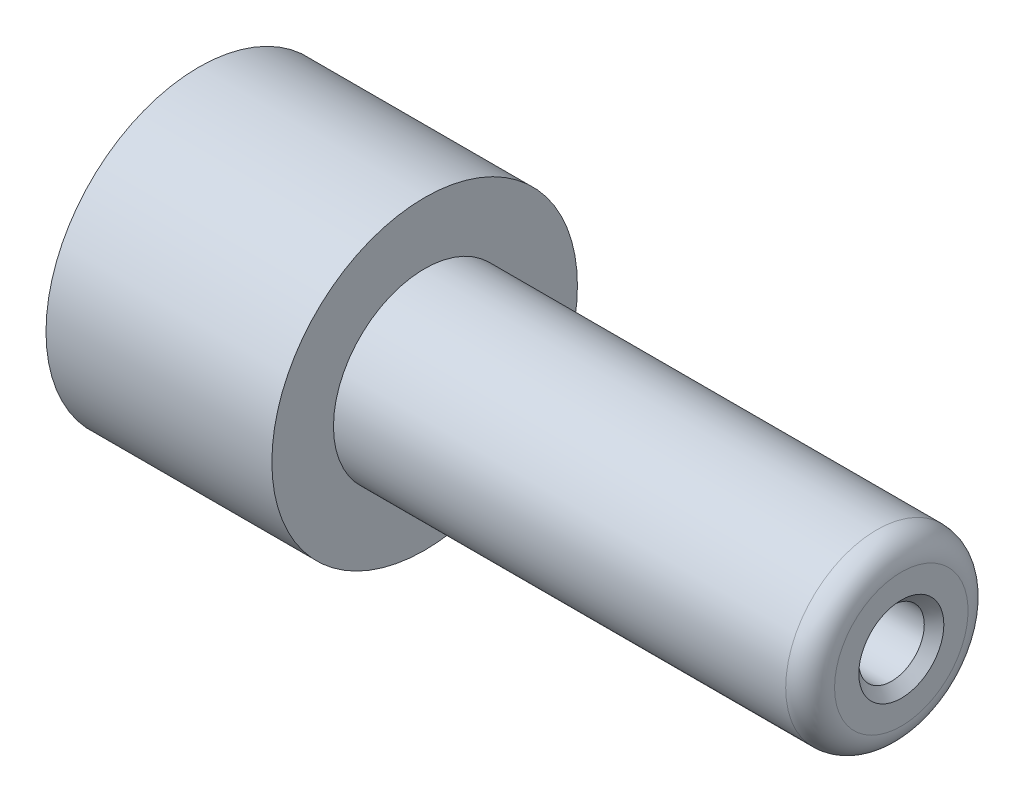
ISO-10303-21;
HEADER;
FILE_DESCRIPTION(('STEP AP214'),'2;1');
FILE_NAME('part.step','',(''),(''),'','','');
FILE_SCHEMA(('AUTOMOTIVE_DESIGN { 1 0 10303 214 1 1 1 1 }'));
ENDSEC;
DATA;
#1=APPLICATION_CONTEXT('core data for automotive mechanical design processes');
#2=APPLICATION_PROTOCOL_DEFINITION('international standard','automotive_design',2000,#1);
#3=PRODUCT_CONTEXT('',#1,'mechanical');
#4=PRODUCT('Part','Part','',(#3));
#5=PRODUCT_RELATED_PRODUCT_CATEGORY('part','',(#4));
#6=PRODUCT_DEFINITION_FORMATION('','',#4);
#7=PRODUCT_DEFINITION_CONTEXT('part definition',#1,'design');
#8=PRODUCT_DEFINITION('design','',#6,#7);
#9=PRODUCT_DEFINITION_SHAPE('','',#8);
#10=(LENGTH_UNIT() NAMED_UNIT(*) SI_UNIT(.MILLI.,.METRE.));
#11=(NAMED_UNIT(*) PLANE_ANGLE_UNIT() SI_UNIT($,.RADIAN.));
#12=(NAMED_UNIT(*) SI_UNIT($,.STERADIAN.) SOLID_ANGLE_UNIT());
#13=UNCERTAINTY_MEASURE_WITH_UNIT(LENGTH_MEASURE(1.E-05),#10,'distance_accuracy_value','');
#14=(GEOMETRIC_REPRESENTATION_CONTEXT(3) GLOBAL_UNCERTAINTY_ASSIGNED_CONTEXT((#13)) GLOBAL_UNIT_ASSIGNED_CONTEXT((#10,
#11,#12)) REPRESENTATION_CONTEXT('',''));
#15=CARTESIAN_POINT('',(0.,0.,0.));
#16=DIRECTION('',(0.,0.,1.));
#17=DIRECTION('',(1.,0.,0.));
#18=AXIS2_PLACEMENT_3D('',#15,#16,#17);
#19=CARTESIAN_POINT('',(0.,0.,0.));
#20=DIRECTION('',(-1.,0.,0.));
#21=DIRECTION('',(0.,0.,1.));
#22=AXIS2_PLACEMENT_3D('',#19,#20,#21);
#23=CYLINDRICAL_SURFACE('',#22,3.5687);
#24=CARTESIAN_POINT('',(24.4856,0.,0.));
#25=DIRECTION('',(-1.,0.,0.));
#26=DIRECTION('',(0.,0.,1.));
#27=AXIS2_PLACEMENT_3D('',#24,#25,#26);
#28=CIRCLE('',#27,3.5687);
#29=CARTESIAN_POINT('',(24.4856,0.,3.5687));
#30=VERTEX_POINT('',#29);
#31=EDGE_CURVE('E44',#30,#30,#28,.T.);
#32=ORIENTED_EDGE('',*,*,#31,.F.);
#33=EDGE_LOOP('',(#32));
#34=FACE_BOUND('',#33,.T.);
#35=CARTESIAN_POINT('',(0.,0.,0.));
#36=DIRECTION('',(-1.,0.,0.));
#37=DIRECTION('',(0.,0.,1.));
#38=AXIS2_PLACEMENT_3D('',#35,#36,#37);
#39=CIRCLE('',#38,3.5687);
#40=CARTESIAN_POINT('',(0.,0.,3.5687));
#41=VERTEX_POINT('',#40);
#42=EDGE_CURVE('E65',#41,#41,#39,.T.);
#43=ORIENTED_EDGE('',*,*,#42,.T.);
#44=EDGE_LOOP('',(#43));
#45=FACE_BOUND('',#44,.T.);
#46=ADVANCED_FACE('F33',(#34,#45),#23,.F.);
#47=CARTESIAN_POINT('',(24.4856,3.5687,0.));
#48=DIRECTION('',(1.,0.,0.));
#49=DIRECTION('',(0.,0.,-1.));
#50=AXIS2_PLACEMENT_3D('',#47,#48,#49);
#51=PLANE('',#50);
#52=ORIENTED_EDGE('',*,*,#31,.T.);
#53=EDGE_LOOP('',(#52));
#54=FACE_BOUND('',#53,.T.);
#55=ADVANCED_FACE('F99',(#54),#51,.F.);
#56=CARTESIAN_POINT('',(36.4998,3.4671,0.));
#57=DIRECTION('',(-1.,0.,0.));
#58=DIRECTION('',(0.,0.,1.));
#59=AXIS2_PLACEMENT_3D('',#56,#57,#58);
#60=PLANE('',#59);
#61=CARTESIAN_POINT('',(36.4998,0.,0.));
#62=DIRECTION('',(-1.,0.,0.));
#63=DIRECTION('',(0.,0.,1.));
#64=AXIS2_PLACEMENT_3D('',#61,#62,#63);
#65=CIRCLE('',#64,2.20980000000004);
#66=CARTESIAN_POINT('',(36.4998,0.,2.20980000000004));
#67=VERTEX_POINT('',#66);
#68=EDGE_CURVE('E10',#67,#67,#65,.T.);
#69=ORIENTED_EDGE('',*,*,#68,.T.);
#70=EDGE_LOOP('',(#69));
#71=FACE_BOUND('',#70,.T.);
#72=CARTESIAN_POINT('',(36.4998,0.,0.));
#73=DIRECTION('',(-1.,0.,0.));
#74=DIRECTION('',(0.,0.,1.));
#75=AXIS2_PLACEMENT_3D('',#72,#73,#74);
#76=CIRCLE('',#75,3.4671);
#77=CARTESIAN_POINT('',(36.4998,0.,3.4671));
#78=VERTEX_POINT('',#77);
#79=EDGE_CURVE('E48',#78,#78,#76,.T.);
#80=ORIENTED_EDGE('',*,*,#79,.F.);
#81=EDGE_LOOP('',(#80));
#82=FACE_BOUND('',#81,.T.);
#83=ADVANCED_FACE('F104',(#71,#82),#60,.F.);
#84=CARTESIAN_POINT('',(35.2298,0.,0.));
#85=DIRECTION('',(-1.,0.,0.));
#86=DIRECTION('',(0.,0.,1.));
#87=AXIS2_PLACEMENT_3D('',#84,#85,#86);
#88=TOROIDAL_SURFACE('',#87,3.4671,1.27);
#89=CARTESIAN_POINT('',(35.2298,0.,0.));
#90=DIRECTION('',(-1.,0.,0.));
#91=DIRECTION('',(0.,0.,1.));
#92=AXIS2_PLACEMENT_3D('',#89,#90,#91);
#93=CIRCLE('',#92,4.7371);
#94=CARTESIAN_POINT('',(35.2298,0.,4.7371));
#95=VERTEX_POINT('',#94);
#96=EDGE_CURVE('E53',#95,#95,#93,.T.);
#97=ORIENTED_EDGE('',*,*,#96,.F.);
#98=EDGE_LOOP('',(#97));
#99=FACE_BOUND('',#98,.T.);
#100=ORIENTED_EDGE('',*,*,#79,.T.);
#101=EDGE_LOOP('',(#100));
#102=FACE_BOUND('',#101,.T.);
#103=ADVANCED_FACE('F112',(#99,#102),#88,.T.);
#104=CARTESIAN_POINT('',(0.,0.,0.));
#105=DIRECTION('',(-1.,0.,0.));
#106=DIRECTION('',(0.,0.,1.));
#107=AXIS2_PLACEMENT_3D('',#104,#105,#106);
#108=CYLINDRICAL_SURFACE('',#107,4.7371);
#109=CARTESIAN_POINT('',(11.7348,0.,0.));
#110=DIRECTION('',(-1.,0.,0.));
#111=DIRECTION('',(0.,0.,1.));
#112=AXIS2_PLACEMENT_3D('',#109,#110,#111);
#113=CIRCLE('',#112,4.7371);
#114=CARTESIAN_POINT('',(11.7348,0.,4.7371));
#115=VERTEX_POINT('',#114);
#116=EDGE_CURVE('E56',#115,#115,#113,.T.);
#117=ORIENTED_EDGE('',*,*,#116,.F.);
#118=EDGE_LOOP('',(#117));
#119=FACE_BOUND('',#118,.T.);
#120=ORIENTED_EDGE('',*,*,#96,.T.);
#121=EDGE_LOOP('',(#120));
#122=FACE_BOUND('',#121,.T.);
#123=ADVANCED_FACE('F115',(#119,#122),#108,.T.);
#124=CARTESIAN_POINT('',(11.7348,7.9375,0.));
#125=DIRECTION('',(-1.,0.,0.));
#126=DIRECTION('',(0.,0.,1.));
#127=AXIS2_PLACEMENT_3D('',#124,#125,#126);
#128=PLANE('',#127);
#129=CARTESIAN_POINT('',(11.7348,0.,0.));
#130=DIRECTION('',(-1.,0.,0.));
#131=DIRECTION('',(0.,0.,1.));
#132=AXIS2_PLACEMENT_3D('',#129,#130,#131);
#133=CIRCLE('',#132,7.9375);
#134=CARTESIAN_POINT('',(11.7348,0.,7.9375));
#135=VERTEX_POINT('',#134);
#136=EDGE_CURVE('E59',#135,#135,#133,.T.);
#137=ORIENTED_EDGE('',*,*,#136,.F.);
#138=EDGE_LOOP('',(#137));
#139=FACE_BOUND('',#138,.T.);
#140=ORIENTED_EDGE('',*,*,#116,.T.);
#141=EDGE_LOOP('',(#140));
#142=FACE_BOUND('',#141,.T.);
#143=ADVANCED_FACE('F119',(#139,#142),#128,.F.);
#144=CARTESIAN_POINT('',(0.,0.,0.));
#145=DIRECTION('',(-1.,0.,0.));
#146=DIRECTION('',(0.,0.,1.));
#147=AXIS2_PLACEMENT_3D('',#144,#145,#146);
#148=CYLINDRICAL_SURFACE('',#147,7.9375);
#149=CARTESIAN_POINT('',(0.,0.,0.));
#150=DIRECTION('',(-1.,0.,0.));
#151=DIRECTION('',(0.,0.,1.));
#152=AXIS2_PLACEMENT_3D('',#149,#150,#151);
#153=CIRCLE('',#152,7.9375);
#154=CARTESIAN_POINT('',(0.,0.,7.9375));
#155=VERTEX_POINT('',#154);
#156=EDGE_CURVE('E62',#155,#155,#153,.T.);
#157=ORIENTED_EDGE('',*,*,#156,.F.);
#158=EDGE_LOOP('',(#157));
#159=FACE_BOUND('',#158,.T.);
#160=ORIENTED_EDGE('',*,*,#136,.T.);
#161=EDGE_LOOP('',(#160));
#162=FACE_BOUND('',#161,.T.);
#163=ADVANCED_FACE('F123',(#159,#162),#148,.T.);
#164=CARTESIAN_POINT('',(0.,3.5687,0.));
#165=DIRECTION('',(1.,0.,0.));
#166=DIRECTION('',(0.,0.,-1.));
#167=AXIS2_PLACEMENT_3D('',#164,#165,#166);
#168=PLANE('',#167);
#169=CARTESIAN_POINT('',(0.,-5.5499,0.));
#170=DIRECTION('',(-1.,0.,0.));
#171=DIRECTION('',(0.,0.,-1.));
#172=AXIS2_PLACEMENT_3D('',#169,#170,#171);
#173=CIRCLE('',#172,1.1811);
#174=CARTESIAN_POINT('',(0.,-5.5499,-1.1811));
#175=VERTEX_POINT('',#174);
#176=EDGE_CURVE('E75',#175,#175,#173,.T.);
#177=ORIENTED_EDGE('',*,*,#176,.F.);
#178=EDGE_LOOP('',(#177));
#179=FACE_BOUND('',#178,.T.);
#180=CARTESIAN_POINT('',(0.,5.5499,0.));
#181=DIRECTION('',(-1.,0.,0.));
#182=DIRECTION('',(0.,0.,1.));
#183=AXIS2_PLACEMENT_3D('',#180,#181,#182);
#184=CIRCLE('',#183,1.1811);
#185=CARTESIAN_POINT('',(0.,5.5499,1.1811));
#186=VERTEX_POINT('',#185);
#187=EDGE_CURVE('E69',#186,#186,#184,.T.);
#188=ORIENTED_EDGE('',*,*,#187,.F.);
#189=EDGE_LOOP('',(#188));
#190=FACE_BOUND('',#189,.T.);
#191=ORIENTED_EDGE('',*,*,#42,.F.);
#192=EDGE_LOOP('',(#191));
#193=FACE_BOUND('',#192,.T.);
#194=ORIENTED_EDGE('',*,*,#156,.T.);
#195=EDGE_LOOP('',(#194));
#196=FACE_BOUND('',#195,.T.);
#197=ADVANCED_FACE('F127',(#179,#190,#193,#196),#168,.F.);
#198=CARTESIAN_POINT('',(2.3876,5.5499,0.));
#199=DIRECTION('',(-1.,0.,0.));
#200=DIRECTION('',(0.,0.,1.));
#201=AXIS2_PLACEMENT_3D('',#198,#199,#200);
#202=CYLINDRICAL_SURFACE('',#201,1.1811);
#203=CARTESIAN_POINT('',(2.3876,5.5499,0.));
#204=DIRECTION('',(-1.,0.,0.));
#205=DIRECTION('',(0.,0.,1.));
#206=AXIS2_PLACEMENT_3D('',#203,#204,#205);
#207=CIRCLE('',#206,1.1811);
#208=CARTESIAN_POINT('',(2.3876,5.5499,1.1811));
#209=VERTEX_POINT('',#208);
#210=EDGE_CURVE('E68',#209,#209,#207,.T.);
#211=ORIENTED_EDGE('',*,*,#210,.F.);
#212=EDGE_LOOP('',(#211));
#213=FACE_BOUND('',#212,.T.);
#214=ORIENTED_EDGE('',*,*,#187,.T.);
#215=EDGE_LOOP('',(#214));
#216=FACE_BOUND('',#215,.T.);
#217=ADVANCED_FACE('F131',(#213,#216),#202,.F.);
#218=CARTESIAN_POINT('',(2.3876,5.5499,0.));
#219=DIRECTION('',(-1.,0.,0.));
#220=DIRECTION('',(0.,0.,1.));
#221=AXIS2_PLACEMENT_3D('',#218,#219,#220);
#222=PLANE('',#221);
#223=ORIENTED_EDGE('',*,*,#210,.T.);
#224=EDGE_LOOP('',(#223));
#225=FACE_BOUND('',#224,.T.);
#226=ADVANCED_FACE('F135',(#225),#222,.T.);
#227=CARTESIAN_POINT('',(2.3876,-5.5499,0.));
#228=DIRECTION('',(-1.,0.,0.));
#229=DIRECTION('',(0.,0.,1.));
#230=AXIS2_PLACEMENT_3D('',#227,#228,#229);
#231=CYLINDRICAL_SURFACE('',#230,1.1811);
#232=CARTESIAN_POINT('',(2.3876,-5.5499,0.));
#233=DIRECTION('',(-1.,0.,0.));
#234=DIRECTION('',(0.,0.,-1.));
#235=AXIS2_PLACEMENT_3D('',#232,#233,#234);
#236=CIRCLE('',#235,1.1811);
#237=CARTESIAN_POINT('',(2.3876,-5.5499,-1.1811));
#238=VERTEX_POINT('',#237);
#239=EDGE_CURVE('E72',#238,#238,#236,.T.);
#240=ORIENTED_EDGE('',*,*,#239,.F.);
#241=EDGE_LOOP('',(#240));
#242=FACE_BOUND('',#241,.T.);
#243=ORIENTED_EDGE('',*,*,#176,.T.);
#244=EDGE_LOOP('',(#243));
#245=FACE_BOUND('',#244,.T.);
#246=ADVANCED_FACE('F95',(#242,#245),#231,.F.);
#247=CARTESIAN_POINT('',(2.3876,-5.5499,0.));
#248=DIRECTION('',(1.,0.,0.));
#249=DIRECTION('',(0.,0.,-1.));
#250=AXIS2_PLACEMENT_3D('',#247,#248,#249);
#251=PLANE('',#250);
#252=ORIENTED_EDGE('',*,*,#239,.T.);
#253=EDGE_LOOP('',(#252));
#254=FACE_BOUND('',#253,.T.);
#255=ADVANCED_FACE('F88',(#254),#251,.F.);
#256=CARTESIAN_POINT('',(26.9748,0.,0.));
#257=DIRECTION('',(1.,0.,0.));
#258=DIRECTION('',(0.,0.,-1.));
#259=AXIS2_PLACEMENT_3D('',#256,#257,#258);
#260=CYLINDRICAL_SURFACE('',#259,1.7018);
#261=CARTESIAN_POINT('',(35.9918,0.,0.));
#262=DIRECTION('',(-1.,0.,0.));
#263=DIRECTION('',(0.,0.,1.));
#264=AXIS2_PLACEMENT_3D('',#261,#262,#263);
#265=CIRCLE('',#264,1.7018);
#266=CARTESIAN_POINT('',(35.9918,0.,-1.7018));
#267=VERTEX_POINT('',#266);
#268=EDGE_CURVE('E40',#267,#267,#265,.F.);
#269=CARTESIAN_POINT('',(26.9748,0.,0.));
#270=DIRECTION('',(1.,0.,0.));
#271=DIRECTION('',(0.,0.,-1.));
#272=AXIS2_PLACEMENT_3D('',#269,#270,#271);
#273=CIRCLE('',#272,1.7018);
#274=CARTESIAN_POINT('',(26.9748,0.,-1.7018));
#275=VERTEX_POINT('',#274);
#276=EDGE_CURVE('E78',#275,#275,#273,.T.);
#277=CARTESIAN_POINT('',(35.9918,0.,-1.7018));
#278=CARTESIAN_POINT('',(35.8978729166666,0.,-1.7018));
#279=CARTESIAN_POINT('',(35.8039458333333,0.,-1.7018));
#280=CARTESIAN_POINT('',(35.6160916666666,0.,-1.7018));
#281=CARTESIAN_POINT('',(35.5221645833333,0.,-1.7018));
#282=CARTESIAN_POINT('',(35.3343104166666,0.,-1.7018));
#283=CARTESIAN_POINT('',(35.2403833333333,0.,-1.7018));
#284=CARTESIAN_POINT('',(35.0525291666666,0.,-1.7018));
#285=CARTESIAN_POINT('',(34.9586020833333,0.,-1.7018));
#286=CARTESIAN_POINT('',(34.7707479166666,0.,-1.7018));
#287=CARTESIAN_POINT('',(34.6768208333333,0.,-1.7018));
#288=CARTESIAN_POINT('',(34.4889666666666,0.,-1.7018));
#289=CARTESIAN_POINT('',(34.3950395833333,0.,-1.7018));
#290=CARTESIAN_POINT('',(34.2071854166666,0.,-1.7018));
#291=CARTESIAN_POINT('',(34.1132583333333,0.,-1.7018));
#292=CARTESIAN_POINT('',(33.9254041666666,0.,-1.7018));
#293=CARTESIAN_POINT('',(33.8314770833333,0.,-1.7018));
#294=CARTESIAN_POINT('',(33.6436229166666,0.,-1.7018));
#295=CARTESIAN_POINT('',(33.5496958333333,0.,-1.7018));
#296=CARTESIAN_POINT('',(33.3618416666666,0.,-1.7018));
#297=CARTESIAN_POINT('',(33.2679145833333,0.,-1.7018));
#298=CARTESIAN_POINT('',(33.0800604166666,0.,-1.7018));
#299=CARTESIAN_POINT('',(32.9861333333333,0.,-1.7018));
#300=CARTESIAN_POINT('',(32.7982791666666,0.,-1.7018));
#301=CARTESIAN_POINT('',(32.7043520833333,0.,-1.7018));
#302=CARTESIAN_POINT('',(32.5164979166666,0.,-1.7018));
#303=CARTESIAN_POINT('',(32.4225708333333,0.,-1.7018));
#304=CARTESIAN_POINT('',(32.2347166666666,0.,-1.7018));
#305=CARTESIAN_POINT('',(32.1407895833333,0.,-1.7018));
#306=CARTESIAN_POINT('',(31.9529354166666,0.,-1.7018));
#307=CARTESIAN_POINT('',(31.8590083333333,0.,-1.7018));
#308=CARTESIAN_POINT('',(31.6711541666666,0.,-1.7018));
#309=CARTESIAN_POINT('',(31.5772270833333,0.,-1.7018));
#310=CARTESIAN_POINT('',(31.3893729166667,0.,-1.7018));
#311=CARTESIAN_POINT('',(31.2954458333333,0.,-1.7018));
#312=CARTESIAN_POINT('',(31.1075916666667,0.,-1.7018));
#313=CARTESIAN_POINT('',(31.0136645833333,0.,-1.7018));
#314=CARTESIAN_POINT('',(30.8258104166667,0.,-1.7018));
#315=CARTESIAN_POINT('',(30.7318833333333,0.,-1.7018));
#316=CARTESIAN_POINT('',(30.5440291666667,0.,-1.7018));
#317=CARTESIAN_POINT('',(30.4501020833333,0.,-1.7018));
#318=CARTESIAN_POINT('',(30.2622479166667,0.,-1.7018));
#319=CARTESIAN_POINT('',(30.1683208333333,0.,-1.7018));
#320=CARTESIAN_POINT('',(29.9804666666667,0.,-1.7018));
#321=CARTESIAN_POINT('',(29.8865395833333,0.,-1.7018));
#322=CARTESIAN_POINT('',(29.6986854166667,0.,-1.7018));
#323=CARTESIAN_POINT('',(29.6047583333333,0.,-1.7018));
#324=CARTESIAN_POINT('',(29.4169041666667,0.,-1.7018));
#325=CARTESIAN_POINT('',(29.3229770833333,0.,-1.7018));
#326=CARTESIAN_POINT('',(29.1351229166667,0.,-1.7018));
#327=CARTESIAN_POINT('',(29.0411958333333,0.,-1.7018));
#328=CARTESIAN_POINT('',(28.8533416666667,0.,-1.7018));
#329=CARTESIAN_POINT('',(28.7594145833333,0.,-1.7018));
#330=CARTESIAN_POINT('',(28.5715604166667,0.,-1.7018));
#331=CARTESIAN_POINT('',(28.4776333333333,0.,-1.7018));
#332=CARTESIAN_POINT('',(28.2897791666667,0.,-1.7018));
#333=CARTESIAN_POINT('',(28.1958520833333,0.,-1.7018));
#334=CARTESIAN_POINT('',(28.0079979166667,0.,-1.7018));
#335=CARTESIAN_POINT('',(27.9140708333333,0.,-1.7018));
#336=CARTESIAN_POINT('',(27.7262166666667,0.,-1.7018));
#337=CARTESIAN_POINT('',(27.6322895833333,0.,-1.7018));
#338=CARTESIAN_POINT('',(27.4444354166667,0.,-1.7018));
#339=CARTESIAN_POINT('',(27.3505083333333,0.,-1.7018));
#340=CARTESIAN_POINT('',(27.1626541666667,0.,-1.7018));
#341=CARTESIAN_POINT('',(27.0687270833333,0.,-1.7018));
#342=CARTESIAN_POINT('',(26.9748,0.,-1.7018));
#343=B_SPLINE_CURVE_WITH_KNOTS('',3,(#277,#278,#279,#280,#281,#282,#283,#284,#285,#286,#287,
#288,#289,#290,#291,#292,#293,#294,#295,#296,#297,#298,#299,#300,#301,#302,#303,#304,#305,#306,
#307,#308,#309,#310,#311,#312,#313,#314,#315,#316,#317,#318,#319,#320,#321,#322,#323,#324,#325,
#326,#327,#328,#329,#330,#331,#332,#333,#334,#335,#336,#337,#338,#339,#340,#341,#342),
.UNSPECIFIED.,.F.,.F.,(4,2,2,2,2,2,2,2,2,2,2,2,2,2,2,2,2,2,2,2,2,2,2,2,2,2,2,2,2,2,2,2,4),(0.,
0.281781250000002,0.563562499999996,0.845343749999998,1.127125,1.40890624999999,1.6906875,
1.97246875,2.25424999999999,2.53603124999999,2.81781249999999,3.09959374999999,3.38137499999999,
3.66315624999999,3.94493749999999,4.22671874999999,4.50849999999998,4.79028124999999,
5.07206249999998,5.35384374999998,5.63562499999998,5.91740624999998,6.19918749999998,
6.48096874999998,6.76274999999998,7.04453124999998,7.32631249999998,7.60809374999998,
7.88987499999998,8.17165624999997,8.45343749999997,8.73521874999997,9.01699999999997),.UNSPECIFIED.);
#344=EDGE_CURVE('BSEAM86',#267,#275,#343,.T.);
#345=ORIENTED_EDGE('',*,*,#268,.T.);
#346=ORIENTED_EDGE('',*,*,#276,.F.);
#347=ORIENTED_EDGE('',*,*,#344,.T.);
#348=ORIENTED_EDGE('',*,*,#344,.F.);
#349=EDGE_LOOP('',(#345,#347,#346,#348));
#350=FACE_BOUND('',#349,.T.);
#351=ADVANCED_FACE('F86',(#350),#260,.F.);
#352=CARTESIAN_POINT('',(26.9748,0.,0.));
#353=DIRECTION('',(1.,0.,0.));
#354=DIRECTION('',(0.,0.,-1.));
#355=AXIS2_PLACEMENT_3D('',#352,#353,#354);
#356=PLANE('',#355);
#357=ORIENTED_EDGE('',*,*,#276,.T.);
#358=EDGE_LOOP('',(#357));
#359=FACE_BOUND('',#358,.T.);
#360=ADVANCED_FACE('F84',(#359),#356,.T.);
#361=CARTESIAN_POINT('',(35.9918,0.,0.));
#362=DIRECTION('',(1.,0.,0.));
#363=DIRECTION('',(0.,0.,-1.));
#364=AXIS2_PLACEMENT_3D('',#361,#362,#363);
#365=CONICAL_SURFACE('',#364,1.7018,0.785398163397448);
#366=ORIENTED_EDGE('',*,*,#68,.F.);
#367=EDGE_LOOP('',(#366));
#368=FACE_BOUND('',#367,.T.);
#369=ORIENTED_EDGE('',*,*,#268,.F.);
#370=EDGE_LOOP('',(#369));
#371=FACE_BOUND('',#370,.T.);
#372=ADVANCED_FACE('F35',(#368,#371),#365,.F.);
#373=CLOSED_SHELL('',(#46,#55,#83,#103,#123,#143,#163,#197,#217,#226,#246,#255,#351,#360,#372));
#374=MANIFOLD_SOLID_BREP('B2',#373);
#375=ADVANCED_BREP_SHAPE_REPRESENTATION('',(#18,#374),#14);
#376=SHAPE_DEFINITION_REPRESENTATION(#9,#375);
ENDSEC;
END-ISO-10303-21;
